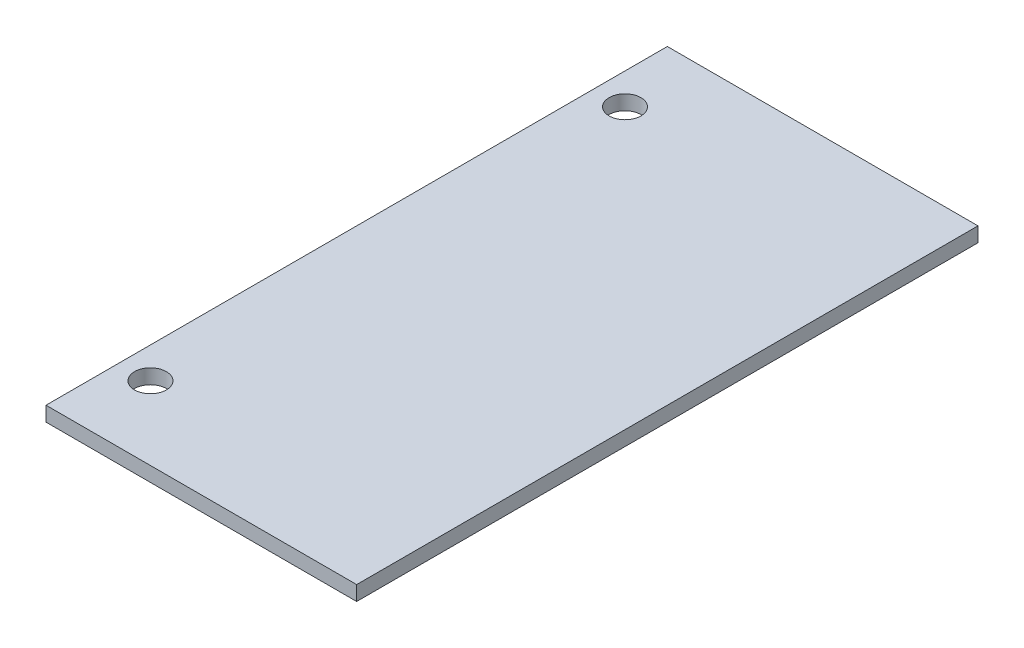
ISO-10303-21;
HEADER;
FILE_DESCRIPTION(('STEP AP214'),'2;1');
FILE_NAME('part.step','',(''),(''),'','','');
FILE_SCHEMA(('AUTOMOTIVE_DESIGN { 1 0 10303 214 1 1 1 1 }'));
ENDSEC;
DATA;
#1=APPLICATION_CONTEXT('core data for automotive mechanical design processes');
#2=APPLICATION_PROTOCOL_DEFINITION('international standard','automotive_design',2000,#1);
#3=PRODUCT_CONTEXT('',#1,'mechanical');
#4=PRODUCT('Part','Part','',(#3));
#5=PRODUCT_RELATED_PRODUCT_CATEGORY('part','',(#4));
#6=PRODUCT_DEFINITION_FORMATION('','',#4);
#7=PRODUCT_DEFINITION_CONTEXT('part definition',#1,'design');
#8=PRODUCT_DEFINITION('design','',#6,#7);
#9=PRODUCT_DEFINITION_SHAPE('','',#8);
#10=(LENGTH_UNIT() NAMED_UNIT(*) SI_UNIT(.MILLI.,.METRE.));
#11=(NAMED_UNIT(*) PLANE_ANGLE_UNIT() SI_UNIT($,.RADIAN.));
#12=(NAMED_UNIT(*) SI_UNIT($,.STERADIAN.) SOLID_ANGLE_UNIT());
#13=UNCERTAINTY_MEASURE_WITH_UNIT(LENGTH_MEASURE(1.E-05),#10,'distance_accuracy_value','');
#14=(GEOMETRIC_REPRESENTATION_CONTEXT(3) GLOBAL_UNCERTAINTY_ASSIGNED_CONTEXT((#13)) GLOBAL_UNIT_ASSIGNED_CONTEXT((#10,
#11,#12)) REPRESENTATION_CONTEXT('',''));
#15=CARTESIAN_POINT('',(0.,0.,0.));
#16=DIRECTION('',(0.,0.,1.));
#17=DIRECTION('',(1.,0.,0.));
#18=AXIS2_PLACEMENT_3D('',#15,#16,#17);
#19=CARTESIAN_POINT('',(-63.5,6.,-127.));
#20=DIRECTION('',(1.,0.,0.));
#21=DIRECTION('',(0.,0.,-1.));
#22=AXIS2_PLACEMENT_3D('',#19,#20,#21);
#23=PLANE('',#22);
#24=DIRECTION('',(0.,0.,1.));
#25=VECTOR('',#24,1.);
#26=CARTESIAN_POINT('',(-63.5,0.,-127.));
#27=LINE('',#26,#25);
#28=CARTESIAN_POINT('',(-63.5,0.,-127.));
#29=VERTEX_POINT('',#28);
#30=CARTESIAN_POINT('',(-63.5,0.,127.));
#31=VERTEX_POINT('',#30);
#32=EDGE_CURVE('E95',#29,#31,#27,.T.);
#33=ORIENTED_EDGE('',*,*,#32,.T.);
#34=DIRECTION('',(0.,-1.,0.));
#35=VECTOR('',#34,1.);
#36=CARTESIAN_POINT('',(-63.5,6.,127.));
#37=LINE('',#36,#35);
#38=CARTESIAN_POINT('',(-63.5,6.,127.));
#39=VERTEX_POINT('',#38);
#40=EDGE_CURVE('E11',#39,#31,#37,.T.);
#41=ORIENTED_EDGE('',*,*,#40,.F.);
#42=DIRECTION('',(0.,0.,1.));
#43=VECTOR('',#42,1.);
#44=CARTESIAN_POINT('',(-63.5,6.,-127.));
#45=LINE('',#44,#43);
#46=CARTESIAN_POINT('',(-63.5,6.,-127.));
#47=VERTEX_POINT('',#46);
#48=EDGE_CURVE('E83',#47,#39,#45,.T.);
#49=ORIENTED_EDGE('',*,*,#48,.F.);
#50=DIRECTION('',(0.,-1.,0.));
#51=VECTOR('',#50,1.);
#52=CARTESIAN_POINT('',(-63.5,6.,-127.));
#53=LINE('',#52,#51);
#54=EDGE_CURVE('E91',#47,#29,#53,.T.);
#55=ORIENTED_EDGE('',*,*,#54,.T.);
#56=EDGE_LOOP('',(#33,#41,#49,#55));
#57=FACE_BOUND('',#56,.T.);
#58=ADVANCED_FACE('F32',(#57),#23,.F.);
#59=CARTESIAN_POINT('',(-63.5,6.,127.));
#60=DIRECTION('',(0.,0.,-1.));
#61=DIRECTION('',(-1.,0.,0.));
#62=AXIS2_PLACEMENT_3D('',#59,#60,#61);
#63=PLANE('',#62);
#64=DIRECTION('',(1.,0.,0.));
#65=VECTOR('',#64,1.);
#66=CARTESIAN_POINT('',(-63.5,0.,127.));
#67=LINE('',#66,#65);
#68=CARTESIAN_POINT('',(63.5,0.,127.));
#69=VERTEX_POINT('',#68);
#70=EDGE_CURVE('E87',#31,#69,#67,.T.);
#71=ORIENTED_EDGE('',*,*,#70,.T.);
#72=DIRECTION('',(0.,-1.,0.));
#73=VECTOR('',#72,1.);
#74=CARTESIAN_POINT('',(63.5,6.,127.));
#75=LINE('',#74,#73);
#76=CARTESIAN_POINT('',(63.5,6.,127.));
#77=VERTEX_POINT('',#76);
#78=EDGE_CURVE('E40',#77,#69,#75,.T.);
#79=ORIENTED_EDGE('',*,*,#78,.F.);
#80=DIRECTION('',(1.,0.,0.));
#81=VECTOR('',#80,1.);
#82=CARTESIAN_POINT('',(-63.5,6.,127.));
#83=LINE('',#82,#81);
#84=EDGE_CURVE('E78',#39,#77,#83,.T.);
#85=ORIENTED_EDGE('',*,*,#84,.F.);
#86=ORIENTED_EDGE('',*,*,#40,.T.);
#87=EDGE_LOOP('',(#71,#79,#85,#86));
#88=FACE_BOUND('',#87,.T.);
#89=ADVANCED_FACE('F86',(#88),#63,.F.);
#90=CARTESIAN_POINT('',(63.5,6.,-127.));
#91=DIRECTION('',(-1.,0.,0.));
#92=DIRECTION('',(0.,0.,1.));
#93=AXIS2_PLACEMENT_3D('',#90,#91,#92);
#94=PLANE('',#93);
#95=DIRECTION('',(0.,0.,-1.));
#96=VECTOR('',#95,1.);
#97=CARTESIAN_POINT('',(63.5,0.,-127.));
#98=LINE('',#97,#96);
#99=CARTESIAN_POINT('',(63.5,0.,-127.));
#100=VERTEX_POINT('',#99);
#101=EDGE_CURVE('E65',#69,#100,#98,.T.);
#102=ORIENTED_EDGE('',*,*,#101,.T.);
#103=DIRECTION('',(0.,-1.,0.));
#104=VECTOR('',#103,1.);
#105=CARTESIAN_POINT('',(63.5,6.,-127.));
#106=LINE('',#105,#104);
#107=CARTESIAN_POINT('',(63.5,6.,-127.));
#108=VERTEX_POINT('',#107);
#109=EDGE_CURVE('E88',#108,#100,#106,.T.);
#110=ORIENTED_EDGE('',*,*,#109,.F.);
#111=DIRECTION('',(0.,0.,-1.));
#112=VECTOR('',#111,1.);
#113=CARTESIAN_POINT('',(63.5,6.,-127.));
#114=LINE('',#113,#112);
#115=EDGE_CURVE('E81',#77,#108,#114,.T.);
#116=ORIENTED_EDGE('',*,*,#115,.F.);
#117=ORIENTED_EDGE('',*,*,#78,.T.);
#118=EDGE_LOOP('',(#102,#110,#116,#117));
#119=FACE_BOUND('',#118,.T.);
#120=ADVANCED_FACE('F89',(#119),#94,.F.);
#121=CARTESIAN_POINT('',(-63.5,6.,-127.));
#122=DIRECTION('',(0.,0.,1.));
#123=DIRECTION('',(1.,0.,0.));
#124=AXIS2_PLACEMENT_3D('',#121,#122,#123);
#125=PLANE('',#124);
#126=DIRECTION('',(-1.,0.,0.));
#127=VECTOR('',#126,1.);
#128=CARTESIAN_POINT('',(-63.5,0.,-127.));
#129=LINE('',#128,#127);
#130=EDGE_CURVE('E71',#100,#29,#129,.T.);
#131=ORIENTED_EDGE('',*,*,#130,.T.);
#132=ORIENTED_EDGE('',*,*,#54,.F.);
#133=DIRECTION('',(-1.,0.,0.));
#134=VECTOR('',#133,1.);
#135=CARTESIAN_POINT('',(-63.5,6.,-127.));
#136=LINE('',#135,#134);
#137=EDGE_CURVE('E48',#108,#47,#136,.T.);
#138=ORIENTED_EDGE('',*,*,#137,.F.);
#139=ORIENTED_EDGE('',*,*,#109,.T.);
#140=EDGE_LOOP('',(#131,#132,#138,#139));
#141=FACE_BOUND('',#140,.T.);
#142=ADVANCED_FACE('F103',(#141),#125,.F.);
#143=CARTESIAN_POINT('',(-63.5,6.,127.));
#144=DIRECTION('',(0.,1.,0.));
#145=DIRECTION('',(0.,0.,1.));
#146=AXIS2_PLACEMENT_3D('',#143,#144,#145);
#147=PLANE('',#146);
#148=CARTESIAN_POINT('',(-50.8,6.,-97.));
#149=DIRECTION('',(0.,1.,0.));
#150=DIRECTION('',(0.,0.,1.));
#151=AXIS2_PLACEMENT_3D('',#148,#149,#150);
#152=CIRCLE('',#151,6.5);
#153=CARTESIAN_POINT('',(-50.8,6.,-90.5));
#154=VERTEX_POINT('',#153);
#155=EDGE_CURVE('E115',#154,#154,#152,.T.);
#156=ORIENTED_EDGE('',*,*,#155,.F.);
#157=EDGE_LOOP('',(#156));
#158=FACE_BOUND('',#157,.T.);
#159=CARTESIAN_POINT('',(-50.8,6.,97.));
#160=DIRECTION('',(0.,1.,0.));
#161=DIRECTION('',(0.,0.,1.));
#162=AXIS2_PLACEMENT_3D('',#159,#160,#161);
#163=CIRCLE('',#162,6.5);
#164=CARTESIAN_POINT('',(-50.8,6.,103.5));
#165=VERTEX_POINT('',#164);
#166=EDGE_CURVE('E109',#165,#165,#163,.T.);
#167=ORIENTED_EDGE('',*,*,#166,.F.);
#168=EDGE_LOOP('',(#167));
#169=FACE_BOUND('',#168,.T.);
#170=ORIENTED_EDGE('',*,*,#48,.T.);
#171=ORIENTED_EDGE('',*,*,#84,.T.);
#172=ORIENTED_EDGE('',*,*,#115,.T.);
#173=ORIENTED_EDGE('',*,*,#137,.T.);
#174=EDGE_LOOP('',(#170,#171,#172,#173));
#175=FACE_BOUND('',#174,.T.);
#176=ADVANCED_FACE('F79',(#158,#169,#175),#147,.T.);
#177=CARTESIAN_POINT('',(-63.5,0.,127.));
#178=DIRECTION('',(0.,1.,0.));
#179=DIRECTION('',(0.,0.,1.));
#180=AXIS2_PLACEMENT_3D('',#177,#178,#179);
#181=PLANE('',#180);
#182=CARTESIAN_POINT('',(-50.8,0.,-97.));
#183=DIRECTION('',(0.,1.,0.));
#184=DIRECTION('',(0.,0.,1.));
#185=AXIS2_PLACEMENT_3D('',#182,#183,#184);
#186=CIRCLE('',#185,6.5);
#187=CARTESIAN_POINT('',(-50.8,0.,-90.5));
#188=VERTEX_POINT('',#187);
#189=EDGE_CURVE('E112',#188,#188,#186,.T.);
#190=ORIENTED_EDGE('',*,*,#189,.T.);
#191=EDGE_LOOP('',(#190));
#192=FACE_BOUND('',#191,.T.);
#193=CARTESIAN_POINT('',(-50.8,0.,97.));
#194=DIRECTION('',(0.,1.,0.));
#195=DIRECTION('',(0.,0.,1.));
#196=AXIS2_PLACEMENT_3D('',#193,#194,#195);
#197=CIRCLE('',#196,6.5);
#198=CARTESIAN_POINT('',(-50.8,0.,103.5));
#199=VERTEX_POINT('',#198);
#200=EDGE_CURVE('E98',#199,#199,#197,.T.);
#201=ORIENTED_EDGE('',*,*,#200,.T.);
#202=EDGE_LOOP('',(#201));
#203=FACE_BOUND('',#202,.T.);
#204=ORIENTED_EDGE('',*,*,#32,.F.);
#205=ORIENTED_EDGE('',*,*,#130,.F.);
#206=ORIENTED_EDGE('',*,*,#101,.F.);
#207=ORIENTED_EDGE('',*,*,#70,.F.);
#208=EDGE_LOOP('',(#204,#205,#206,#207));
#209=FACE_BOUND('',#208,.T.);
#210=ADVANCED_FACE('F106',(#192,#203,#209),#181,.F.);
#211=CARTESIAN_POINT('',(-50.8,0.,97.));
#212=DIRECTION('',(0.,1.,0.));
#213=DIRECTION('',(0.,0.,1.));
#214=AXIS2_PLACEMENT_3D('',#211,#212,#213);
#215=CYLINDRICAL_SURFACE('',#214,6.5);
#216=ORIENTED_EDGE('',*,*,#200,.F.);
#217=EDGE_LOOP('',(#216));
#218=FACE_BOUND('',#217,.T.);
#219=ORIENTED_EDGE('',*,*,#166,.T.);
#220=EDGE_LOOP('',(#219));
#221=FACE_BOUND('',#220,.T.);
#222=ADVANCED_FACE('F126',(#218,#221),#215,.F.);
#223=CARTESIAN_POINT('',(-50.8,0.,-97.));
#224=DIRECTION('',(0.,1.,0.));
#225=DIRECTION('',(0.,0.,1.));
#226=AXIS2_PLACEMENT_3D('',#223,#224,#225);
#227=CYLINDRICAL_SURFACE('',#226,6.5);
#228=ORIENTED_EDGE('',*,*,#189,.F.);
#229=EDGE_LOOP('',(#228));
#230=FACE_BOUND('',#229,.T.);
#231=ORIENTED_EDGE('',*,*,#155,.T.);
#232=EDGE_LOOP('',(#231));
#233=FACE_BOUND('',#232,.T.);
#234=ADVANCED_FACE('F123',(#230,#233),#227,.F.);
#235=CLOSED_SHELL('',(#58,#89,#120,#142,#176,#210,#222,#234));
#236=MANIFOLD_SOLID_BREP('B2',#235);
#237=ADVANCED_BREP_SHAPE_REPRESENTATION('',(#18,#236),#14);
#238=SHAPE_DEFINITION_REPRESENTATION(#9,#237);
ENDSEC;
END-ISO-10303-21;
